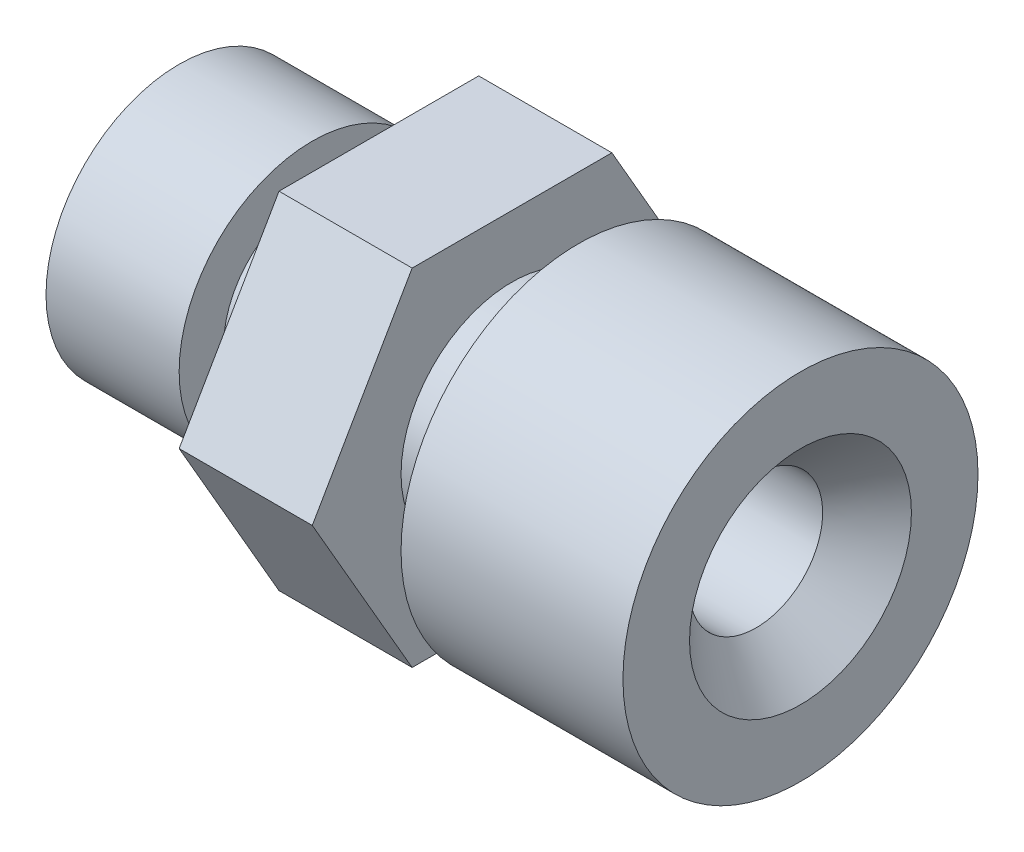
ISO-10303-21;
HEADER;
FILE_DESCRIPTION(('STEP AP214'),'2;1');
FILE_NAME('part.step','',(''),(''),'','','');
FILE_SCHEMA(('AUTOMOTIVE_DESIGN { 1 0 10303 214 1 1 1 1 }'));
ENDSEC;
DATA;
#1=APPLICATION_CONTEXT('core data for automotive mechanical design processes');
#2=APPLICATION_PROTOCOL_DEFINITION('international standard','automotive_design',2000,#1);
#3=PRODUCT_CONTEXT('',#1,'mechanical');
#4=PRODUCT('Part','Part','',(#3));
#5=PRODUCT_RELATED_PRODUCT_CATEGORY('part','',(#4));
#6=PRODUCT_DEFINITION_FORMATION('','',#4);
#7=PRODUCT_DEFINITION_CONTEXT('part definition',#1,'design');
#8=PRODUCT_DEFINITION('design','',#6,#7);
#9=PRODUCT_DEFINITION_SHAPE('','',#8);
#10=(LENGTH_UNIT() NAMED_UNIT(*) SI_UNIT(.MILLI.,.METRE.));
#11=(NAMED_UNIT(*) PLANE_ANGLE_UNIT() SI_UNIT($,.RADIAN.));
#12=(NAMED_UNIT(*) SI_UNIT($,.STERADIAN.) SOLID_ANGLE_UNIT());
#13=UNCERTAINTY_MEASURE_WITH_UNIT(LENGTH_MEASURE(1.E-05),#10,'distance_accuracy_value','');
#14=(GEOMETRIC_REPRESENTATION_CONTEXT(3) GLOBAL_UNCERTAINTY_ASSIGNED_CONTEXT((#13)) GLOBAL_UNIT_ASSIGNED_CONTEXT((#10,
#11,#12)) REPRESENTATION_CONTEXT('',''));
#15=CARTESIAN_POINT('',(0.,0.,0.));
#16=DIRECTION('',(0.,0.,1.));
#17=DIRECTION('',(1.,0.,0.));
#18=AXIS2_PLACEMENT_3D('',#15,#16,#17);
#19=CARTESIAN_POINT('',(15.,9.,0.));
#20=DIRECTION('',(-1.,0.,0.));
#21=DIRECTION('',(0.,0.,1.));
#22=AXIS2_PLACEMENT_3D('',#19,#20,#21);
#23=PLANE('',#22);
#24=CARTESIAN_POINT('',(15.,0.,0.));
#25=DIRECTION('',(-1.,0.,0.));
#26=DIRECTION('',(0.,0.,1.));
#27=AXIS2_PLACEMENT_3D('',#24,#25,#26);
#28=CIRCLE('',#27,5.);
#29=CARTESIAN_POINT('',(15.,0.,5.));
#30=VERTEX_POINT('',#29);
#31=EDGE_CURVE('E134',#30,#30,#28,.T.);
#32=ORIENTED_EDGE('',*,*,#31,.T.);
#33=EDGE_LOOP('',(#32));
#34=FACE_BOUND('',#33,.T.);
#35=DIRECTION('',(0.,0.,1.));
#36=VECTOR('',#35,1.);
#37=CARTESIAN_POINT('',(15.,7.79422863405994,-4.5));
#38=LINE('',#37,#36);
#39=CARTESIAN_POINT('',(15.,7.79422863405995,-4.5));
#40=VERTEX_POINT('',#39);
#41=CARTESIAN_POINT('',(15.,7.79422863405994,4.5));
#42=VERTEX_POINT('',#41);
#43=EDGE_CURVE('E40',#40,#42,#38,.T.);
#44=ORIENTED_EDGE('',*,*,#43,.T.);
#45=DIRECTION('',(0.,-0.866025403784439,0.5));
#46=VECTOR('',#45,1.);
#47=CARTESIAN_POINT('',(15.,7.79422863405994,4.5));
#48=LINE('',#47,#46);
#49=CARTESIAN_POINT('',(15.,0.,9.));
#50=VERTEX_POINT('',#49);
#51=EDGE_CURVE('E88',#42,#50,#48,.T.);
#52=ORIENTED_EDGE('',*,*,#51,.T.);
#53=DIRECTION('',(0.,-0.866025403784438,-0.5));
#54=VECTOR('',#53,1.);
#55=CARTESIAN_POINT('',(15.,0.,9.));
#56=LINE('',#55,#54);
#57=CARTESIAN_POINT('',(15.,-7.79422863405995,4.49999999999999));
#58=VERTEX_POINT('',#57);
#59=EDGE_CURVE('E94',#50,#58,#56,.T.);
#60=ORIENTED_EDGE('',*,*,#59,.T.);
#61=DIRECTION('',(0.,0.,-1.));
#62=VECTOR('',#61,1.);
#63=CARTESIAN_POINT('',(15.,-7.79422863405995,4.49999999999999));
#64=LINE('',#63,#62);
#65=CARTESIAN_POINT('',(15.,-7.79422863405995,-4.5));
#66=VERTEX_POINT('',#65);
#67=EDGE_CURVE('E104',#58,#66,#64,.T.);
#68=ORIENTED_EDGE('',*,*,#67,.T.);
#69=DIRECTION('',(0.,0.866025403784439,-0.5));
#70=VECTOR('',#69,1.);
#71=CARTESIAN_POINT('',(15.,-7.79422863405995,-4.5));
#72=LINE('',#71,#70);
#73=CARTESIAN_POINT('',(15.,0.,-9.));
#74=VERTEX_POINT('',#73);
#75=EDGE_CURVE('E107',#66,#74,#72,.T.);
#76=ORIENTED_EDGE('',*,*,#75,.T.);
#77=DIRECTION('',(0.,0.866025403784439,0.5));
#78=VECTOR('',#77,1.);
#79=CARTESIAN_POINT('',(15.,0.,-9.));
#80=LINE('',#79,#78);
#81=EDGE_CURVE('E98',#74,#40,#80,.T.);
#82=ORIENTED_EDGE('',*,*,#81,.T.);
#83=EDGE_LOOP('',(#44,#52,#60,#68,#76,#82));
#84=FACE_BOUND('',#83,.T.);
#85=ADVANCED_FACE('F25',(#34,#84),#23,.F.);
#86=CARTESIAN_POINT('',(8.99999999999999,4.,0.));
#87=DIRECTION('',(1.,0.,0.));
#88=DIRECTION('',(0.,0.,-1.));
#89=AXIS2_PLACEMENT_3D('',#86,#87,#88);
#90=PLANE('',#89);
#91=CARTESIAN_POINT('',(8.99999999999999,0.,0.));
#92=DIRECTION('',(-1.,0.,0.));
#93=DIRECTION('',(0.,0.,1.));
#94=AXIS2_PLACEMENT_3D('',#91,#92,#93);
#95=CIRCLE('',#94,4.);
#96=CARTESIAN_POINT('',(8.99999999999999,0.,4.));
#97=VERTEX_POINT('',#96);
#98=EDGE_CURVE('E131',#97,#97,#95,.T.);
#99=ORIENTED_EDGE('',*,*,#98,.F.);
#100=EDGE_LOOP('',(#99));
#101=FACE_BOUND('',#100,.T.);
#102=DIRECTION('',(0.,0.,-1.));
#103=VECTOR('',#102,1.);
#104=CARTESIAN_POINT('',(8.99999999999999,7.79422863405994,-4.5));
#105=LINE('',#104,#103);
#106=CARTESIAN_POINT('',(8.99999999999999,7.79422863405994,4.5));
#107=VERTEX_POINT('',#106);
#108=CARTESIAN_POINT('',(8.99999999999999,7.79422863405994,-4.5));
#109=VERTEX_POINT('',#108);
#110=EDGE_CURVE('E81',#107,#109,#105,.T.);
#111=ORIENTED_EDGE('',*,*,#110,.T.);
#112=DIRECTION('',(0.,-0.866025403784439,-0.5));
#113=VECTOR('',#112,1.);
#114=CARTESIAN_POINT('',(8.99999999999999,0.,-9.00000000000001));
#115=LINE('',#114,#113);
#116=CARTESIAN_POINT('',(8.99999999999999,0.,-9.00000000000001));
#117=VERTEX_POINT('',#116);
#118=EDGE_CURVE('E117',#109,#117,#115,.T.);
#119=ORIENTED_EDGE('',*,*,#118,.T.);
#120=DIRECTION('',(0.,-0.866025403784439,0.5));
#121=VECTOR('',#120,1.);
#122=CARTESIAN_POINT('',(8.99999999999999,-7.79422863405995,-4.5));
#123=LINE('',#122,#121);
#124=CARTESIAN_POINT('',(8.99999999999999,-7.79422863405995,-4.5));
#125=VERTEX_POINT('',#124);
#126=EDGE_CURVE('E229',#117,#125,#123,.T.);
#127=ORIENTED_EDGE('',*,*,#126,.T.);
#128=DIRECTION('',(0.,0.,1.));
#129=VECTOR('',#128,1.);
#130=CARTESIAN_POINT('',(8.99999999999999,-7.79422863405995,4.49999999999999));
#131=LINE('',#130,#129);
#132=CARTESIAN_POINT('',(8.99999999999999,-7.79422863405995,4.5));
#133=VERTEX_POINT('',#132);
#134=EDGE_CURVE('E225',#125,#133,#131,.T.);
#135=ORIENTED_EDGE('',*,*,#134,.T.);
#136=DIRECTION('',(0.,0.866025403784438,0.5));
#137=VECTOR('',#136,1.);
#138=CARTESIAN_POINT('',(9.00000000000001,0.,8.99999999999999));
#139=LINE('',#138,#137);
#140=CARTESIAN_POINT('',(9.00000000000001,0.,8.99999999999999));
#141=VERTEX_POINT('',#140);
#142=EDGE_CURVE('E223',#133,#141,#139,.T.);
#143=ORIENTED_EDGE('',*,*,#142,.T.);
#144=DIRECTION('',(0.,0.866025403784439,-0.5));
#145=VECTOR('',#144,1.);
#146=CARTESIAN_POINT('',(8.99999999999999,7.79422863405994,4.5));
#147=LINE('',#146,#145);
#148=EDGE_CURVE('E122',#141,#107,#147,.T.);
#149=ORIENTED_EDGE('',*,*,#148,.T.);
#150=EDGE_LOOP('',(#111,#119,#127,#135,#143,#149));
#151=FACE_BOUND('',#150,.T.);
#152=ADVANCED_FACE('F164',(#101,#151),#90,.F.);
#153=CARTESIAN_POINT('',(0.,0.,0.));
#154=DIRECTION('',(-1.,0.,0.));
#155=DIRECTION('',(0.,0.,1.));
#156=AXIS2_PLACEMENT_3D('',#153,#154,#155);
#157=CYLINDRICAL_SURFACE('',#156,2.99999999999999);
#158=CARTESIAN_POINT('',(26.,0.,0.));
#159=DIRECTION('',(-1.,0.,0.));
#160=DIRECTION('',(0.,0.,1.));
#161=AXIS2_PLACEMENT_3D('',#158,#159,#160);
#162=CIRCLE('',#161,2.99999999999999);
#163=CARTESIAN_POINT('',(26.,0.,2.99999999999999));
#164=VERTEX_POINT('',#163);
#165=EDGE_CURVE('E11',#164,#164,#162,.F.);
#166=ORIENTED_EDGE('',*,*,#165,.T.);
#167=EDGE_LOOP('',(#166));
#168=FACE_BOUND('',#167,.T.);
#169=CARTESIAN_POINT('',(0.,0.,0.));
#170=DIRECTION('',(-1.,0.,0.));
#171=DIRECTION('',(0.,0.,1.));
#172=AXIS2_PLACEMENT_3D('',#169,#170,#171);
#173=CIRCLE('',#172,2.99999999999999);
#174=CARTESIAN_POINT('',(0.,0.,2.99999999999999));
#175=VERTEX_POINT('',#174);
#176=EDGE_CURVE('E118',#175,#175,#173,.T.);
#177=ORIENTED_EDGE('',*,*,#176,.T.);
#178=EDGE_LOOP('',(#177));
#179=FACE_BOUND('',#178,.T.);
#180=ADVANCED_FACE('F27',(#168,#179),#157,.F.);
#181=CARTESIAN_POINT('',(28.,8.,0.));
#182=DIRECTION('',(-1.,0.,0.));
#183=DIRECTION('',(0.,0.,1.));
#184=AXIS2_PLACEMENT_3D('',#181,#182,#183);
#185=PLANE('',#184);
#186=CARTESIAN_POINT('',(28.,0.,0.));
#187=DIRECTION('',(-1.,0.,0.));
#188=DIRECTION('',(0.,0.,1.));
#189=AXIS2_PLACEMENT_3D('',#186,#187,#188);
#190=CIRCLE('',#189,5.);
#191=CARTESIAN_POINT('',(28.,0.,5.));
#192=VERTEX_POINT('',#191);
#193=EDGE_CURVE('E33',#192,#192,#190,.T.);
#194=ORIENTED_EDGE('',*,*,#193,.T.);
#195=EDGE_LOOP('',(#194));
#196=FACE_BOUND('',#195,.T.);
#197=CARTESIAN_POINT('',(28.,0.,0.));
#198=DIRECTION('',(-1.,0.,0.));
#199=DIRECTION('',(0.,0.,1.));
#200=AXIS2_PLACEMENT_3D('',#197,#198,#199);
#201=CIRCLE('',#200,8.);
#202=CARTESIAN_POINT('',(28.,0.,8.));
#203=VERTEX_POINT('',#202);
#204=EDGE_CURVE('E143',#203,#203,#201,.T.);
#205=ORIENTED_EDGE('',*,*,#204,.F.);
#206=EDGE_LOOP('',(#205));
#207=FACE_BOUND('',#206,.T.);
#208=ADVANCED_FACE('F148',(#196,#207),#185,.F.);
#209=CARTESIAN_POINT('',(0.,0.,0.));
#210=DIRECTION('',(-1.,0.,0.));
#211=DIRECTION('',(0.,0.,1.));
#212=AXIS2_PLACEMENT_3D('',#209,#210,#211);
#213=CYLINDRICAL_SURFACE('',#212,8.);
#214=CARTESIAN_POINT('',(18.,0.,0.));
#215=DIRECTION('',(-1.,0.,0.));
#216=DIRECTION('',(0.,0.,1.));
#217=AXIS2_PLACEMENT_3D('',#214,#215,#216);
#218=CIRCLE('',#217,8.);
#219=CARTESIAN_POINT('',(18.,0.,8.));
#220=VERTEX_POINT('',#219);
#221=EDGE_CURVE('E140',#220,#220,#218,.T.);
#222=ORIENTED_EDGE('',*,*,#221,.F.);
#223=EDGE_LOOP('',(#222));
#224=FACE_BOUND('',#223,.T.);
#225=ORIENTED_EDGE('',*,*,#204,.T.);
#226=EDGE_LOOP('',(#225));
#227=FACE_BOUND('',#226,.T.);
#228=ADVANCED_FACE('F183',(#224,#227),#213,.T.);
#229=CARTESIAN_POINT('',(18.,5.,0.));
#230=DIRECTION('',(1.,0.,0.));
#231=DIRECTION('',(0.,0.,-1.));
#232=AXIS2_PLACEMENT_3D('',#229,#230,#231);
#233=PLANE('',#232);
#234=CARTESIAN_POINT('',(18.,0.,0.));
#235=DIRECTION('',(-1.,0.,0.));
#236=DIRECTION('',(0.,0.,1.));
#237=AXIS2_PLACEMENT_3D('',#234,#235,#236);
#238=CIRCLE('',#237,5.);
#239=CARTESIAN_POINT('',(18.,0.,5.));
#240=VERTEX_POINT('',#239);
#241=EDGE_CURVE('E137',#240,#240,#238,.T.);
#242=ORIENTED_EDGE('',*,*,#241,.F.);
#243=EDGE_LOOP('',(#242));
#244=FACE_BOUND('',#243,.T.);
#245=ORIENTED_EDGE('',*,*,#221,.T.);
#246=EDGE_LOOP('',(#245));
#247=FACE_BOUND('',#246,.T.);
#248=ADVANCED_FACE('F179',(#244,#247),#233,.F.);
#249=CARTESIAN_POINT('',(0.,0.,0.));
#250=DIRECTION('',(-1.,0.,0.));
#251=DIRECTION('',(0.,0.,1.));
#252=AXIS2_PLACEMENT_3D('',#249,#250,#251);
#253=CYLINDRICAL_SURFACE('',#252,5.);
#254=ORIENTED_EDGE('',*,*,#31,.F.);
#255=EDGE_LOOP('',(#254));
#256=FACE_BOUND('',#255,.T.);
#257=ORIENTED_EDGE('',*,*,#241,.T.);
#258=EDGE_LOOP('',(#257));
#259=FACE_BOUND('',#258,.T.);
#260=ADVANCED_FACE('F175',(#256,#259),#253,.T.);
#261=CARTESIAN_POINT('',(0.,0.,0.));
#262=DIRECTION('',(-1.,0.,0.));
#263=DIRECTION('',(0.,0.,1.));
#264=AXIS2_PLACEMENT_3D('',#261,#262,#263);
#265=CYLINDRICAL_SURFACE('',#264,4.);
#266=CARTESIAN_POINT('',(5.99999999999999,0.,0.));
#267=DIRECTION('',(-1.,0.,0.));
#268=DIRECTION('',(0.,0.,1.));
#269=AXIS2_PLACEMENT_3D('',#266,#267,#268);
#270=CIRCLE('',#269,4.);
#271=CARTESIAN_POINT('',(5.99999999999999,0.,4.));
#272=VERTEX_POINT('',#271);
#273=EDGE_CURVE('E128',#272,#272,#270,.T.);
#274=ORIENTED_EDGE('',*,*,#273,.F.);
#275=EDGE_LOOP('',(#274));
#276=FACE_BOUND('',#275,.T.);
#277=ORIENTED_EDGE('',*,*,#98,.T.);
#278=EDGE_LOOP('',(#277));
#279=FACE_BOUND('',#278,.T.);
#280=ADVANCED_FACE('F178',(#276,#279),#265,.T.);
#281=CARTESIAN_POINT('',(5.99999999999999,6.,0.));
#282=DIRECTION('',(-1.,0.,0.));
#283=DIRECTION('',(0.,0.,1.));
#284=AXIS2_PLACEMENT_3D('',#281,#282,#283);
#285=PLANE('',#284);
#286=CARTESIAN_POINT('',(5.99999999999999,0.,0.));
#287=DIRECTION('',(-1.,0.,0.));
#288=DIRECTION('',(0.,0.,1.));
#289=AXIS2_PLACEMENT_3D('',#286,#287,#288);
#290=CIRCLE('',#289,6.);
#291=CARTESIAN_POINT('',(5.99999999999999,0.,6.));
#292=VERTEX_POINT('',#291);
#293=EDGE_CURVE('E125',#292,#292,#290,.T.);
#294=ORIENTED_EDGE('',*,*,#293,.F.);
#295=EDGE_LOOP('',(#294));
#296=FACE_BOUND('',#295,.T.);
#297=ORIENTED_EDGE('',*,*,#273,.T.);
#298=EDGE_LOOP('',(#297));
#299=FACE_BOUND('',#298,.T.);
#300=ADVANCED_FACE('F206',(#296,#299),#285,.F.);
#301=CARTESIAN_POINT('',(0.,0.,0.));
#302=DIRECTION('',(-1.,0.,0.));
#303=DIRECTION('',(0.,0.,1.));
#304=AXIS2_PLACEMENT_3D('',#301,#302,#303);
#305=CYLINDRICAL_SURFACE('',#304,6.);
#306=CARTESIAN_POINT('',(0.,0.,0.));
#307=DIRECTION('',(-1.,0.,0.));
#308=DIRECTION('',(0.,0.,1.));
#309=AXIS2_PLACEMENT_3D('',#306,#307,#308);
#310=CIRCLE('',#309,6.);
#311=CARTESIAN_POINT('',(0.,0.,6.));
#312=VERTEX_POINT('',#311);
#313=EDGE_CURVE('E121',#312,#312,#310,.T.);
#314=ORIENTED_EDGE('',*,*,#313,.F.);
#315=EDGE_LOOP('',(#314));
#316=FACE_BOUND('',#315,.T.);
#317=ORIENTED_EDGE('',*,*,#293,.T.);
#318=EDGE_LOOP('',(#317));
#319=FACE_BOUND('',#318,.T.);
#320=ADVANCED_FACE('F200',(#316,#319),#305,.T.);
#321=CARTESIAN_POINT('',(0.,2.99999999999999,0.));
#322=DIRECTION('',(1.,0.,0.));
#323=DIRECTION('',(0.,0.,-1.));
#324=AXIS2_PLACEMENT_3D('',#321,#322,#323);
#325=PLANE('',#324);
#326=ORIENTED_EDGE('',*,*,#176,.F.);
#327=EDGE_LOOP('',(#326));
#328=FACE_BOUND('',#327,.T.);
#329=ORIENTED_EDGE('',*,*,#313,.T.);
#330=EDGE_LOOP('',(#329));
#331=FACE_BOUND('',#330,.T.);
#332=ADVANCED_FACE('F197',(#328,#331),#325,.F.);
#333=CARTESIAN_POINT('',(-23.2997975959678,7.79422863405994,-4.5));
#334=DIRECTION('',(0.,1.,0.));
#335=DIRECTION('',(0.,0.,1.));
#336=AXIS2_PLACEMENT_3D('',#333,#334,#335);
#337=PLANE('',#336);
#338=DIRECTION('',(1.,0.,0.));
#339=VECTOR('',#338,1.);
#340=CARTESIAN_POINT('',(-23.2997975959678,7.79422863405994,4.5));
#341=LINE('',#340,#339);
#342=EDGE_CURVE('E77',#107,#42,#341,.T.);
#343=ORIENTED_EDGE('',*,*,#342,.T.);
#344=ORIENTED_EDGE('',*,*,#43,.F.);
#345=DIRECTION('',(1.,0.,0.));
#346=VECTOR('',#345,1.);
#347=CARTESIAN_POINT('',(-23.2997975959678,7.79422863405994,-4.5));
#348=LINE('',#347,#346);
#349=EDGE_CURVE('E85',#109,#40,#348,.T.);
#350=ORIENTED_EDGE('',*,*,#349,.F.);
#351=ORIENTED_EDGE('',*,*,#110,.F.);
#352=EDGE_LOOP('',(#343,#344,#350,#351));
#353=FACE_BOUND('',#352,.T.);
#354=ADVANCED_FACE('F79',(#353),#337,.T.);
#355=CARTESIAN_POINT('',(-23.2997975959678,7.79422863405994,4.5));
#356=DIRECTION('',(0.,0.5,0.866025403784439));
#357=DIRECTION('',(0.,-0.866025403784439,0.5));
#358=AXIS2_PLACEMENT_3D('',#355,#356,#357);
#359=PLANE('',#358);
#360=DIRECTION('',(1.,0.,0.));
#361=VECTOR('',#360,1.);
#362=CARTESIAN_POINT('',(-23.2997975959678,0.,9.));
#363=LINE('',#362,#361);
#364=EDGE_CURVE('E84',#141,#50,#363,.T.);
#365=ORIENTED_EDGE('',*,*,#364,.T.);
#366=ORIENTED_EDGE('',*,*,#51,.F.);
#367=ORIENTED_EDGE('',*,*,#342,.F.);
#368=ORIENTED_EDGE('',*,*,#148,.F.);
#369=EDGE_LOOP('',(#365,#366,#367,#368));
#370=FACE_BOUND('',#369,.T.);
#371=ADVANCED_FACE('F89',(#370),#359,.T.);
#372=CARTESIAN_POINT('',(-23.2997975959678,0.,9.));
#373=DIRECTION('',(0.,-0.5,0.866025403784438));
#374=DIRECTION('',(0.,-0.866025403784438,-0.5));
#375=AXIS2_PLACEMENT_3D('',#372,#373,#374);
#376=PLANE('',#375);
#377=DIRECTION('',(1.,0.,0.));
#378=VECTOR('',#377,1.);
#379=CARTESIAN_POINT('',(-23.2997975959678,-7.79422863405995,4.49999999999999));
#380=LINE('',#379,#378);
#381=EDGE_CURVE('E112',#133,#58,#380,.T.);
#382=ORIENTED_EDGE('',*,*,#381,.T.);
#383=ORIENTED_EDGE('',*,*,#59,.F.);
#384=ORIENTED_EDGE('',*,*,#364,.F.);
#385=ORIENTED_EDGE('',*,*,#142,.F.);
#386=EDGE_LOOP('',(#382,#383,#384,#385));
#387=FACE_BOUND('',#386,.T.);
#388=ADVANCED_FACE('F238',(#387),#376,.T.);
#389=CARTESIAN_POINT('',(-23.2997975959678,-7.79422863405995,4.49999999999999));
#390=DIRECTION('',(0.,-1.,0.));
#391=DIRECTION('',(0.,0.,-1.));
#392=AXIS2_PLACEMENT_3D('',#389,#390,#391);
#393=PLANE('',#392);
#394=DIRECTION('',(1.,0.,0.));
#395=VECTOR('',#394,1.);
#396=CARTESIAN_POINT('',(-23.2997975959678,-7.79422863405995,-4.5));
#397=LINE('',#396,#395);
#398=EDGE_CURVE('E110',#125,#66,#397,.T.);
#399=ORIENTED_EDGE('',*,*,#398,.T.);
#400=ORIENTED_EDGE('',*,*,#67,.F.);
#401=ORIENTED_EDGE('',*,*,#381,.F.);
#402=ORIENTED_EDGE('',*,*,#134,.F.);
#403=EDGE_LOOP('',(#399,#400,#401,#402));
#404=FACE_BOUND('',#403,.T.);
#405=ADVANCED_FACE('F235',(#404),#393,.T.);
#406=CARTESIAN_POINT('',(-23.2997975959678,-7.79422863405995,-4.5));
#407=DIRECTION('',(0.,-0.5,-0.866025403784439));
#408=DIRECTION('',(0.,0.866025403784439,-0.5));
#409=AXIS2_PLACEMENT_3D('',#406,#407,#408);
#410=PLANE('',#409);
#411=DIRECTION('',(1.,0.,0.));
#412=VECTOR('',#411,1.);
#413=CARTESIAN_POINT('',(-23.2997975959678,0.,-9.));
#414=LINE('',#413,#412);
#415=EDGE_CURVE('E48',#117,#74,#414,.T.);
#416=ORIENTED_EDGE('',*,*,#415,.T.);
#417=ORIENTED_EDGE('',*,*,#75,.F.);
#418=ORIENTED_EDGE('',*,*,#398,.F.);
#419=ORIENTED_EDGE('',*,*,#126,.F.);
#420=EDGE_LOOP('',(#416,#417,#418,#419));
#421=FACE_BOUND('',#420,.T.);
#422=ADVANCED_FACE('F159',(#421),#410,.T.);
#423=CARTESIAN_POINT('',(-23.2997975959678,0.,-9.));
#424=DIRECTION('',(0.,0.5,-0.866025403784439));
#425=DIRECTION('',(0.,0.866025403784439,0.5));
#426=AXIS2_PLACEMENT_3D('',#423,#424,#425);
#427=PLANE('',#426);
#428=ORIENTED_EDGE('',*,*,#349,.T.);
#429=ORIENTED_EDGE('',*,*,#81,.F.);
#430=ORIENTED_EDGE('',*,*,#415,.F.);
#431=ORIENTED_EDGE('',*,*,#118,.F.);
#432=EDGE_LOOP('',(#428,#429,#430,#431));
#433=FACE_BOUND('',#432,.T.);
#434=ADVANCED_FACE('F153',(#433),#427,.T.);
#435=CARTESIAN_POINT('',(28.,0.,0.));
#436=DIRECTION('',(1.,0.,0.));
#437=DIRECTION('',(0.,0.,-1.));
#438=AXIS2_PLACEMENT_3D('',#435,#436,#437);
#439=CONICAL_SURFACE('',#438,5.,0.785398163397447);
#440=ORIENTED_EDGE('',*,*,#165,.F.);
#441=EDGE_LOOP('',(#440));
#442=FACE_BOUND('',#441,.T.);
#443=ORIENTED_EDGE('',*,*,#193,.F.);
#444=EDGE_LOOP('',(#443));
#445=FACE_BOUND('',#444,.T.);
#446=ADVANCED_FACE('F151',(#442,#445),#439,.F.);
#447=CLOSED_SHELL('',(#85,#152,#180,#208,#228,#248,#260,#280,#300,#320,#332,#354,#371,#388,#405,
#422,#434,#446));
#448=MANIFOLD_SOLID_BREP('B2',#447);
#449=ADVANCED_BREP_SHAPE_REPRESENTATION('',(#18,#448),#14);
#450=SHAPE_DEFINITION_REPRESENTATION(#9,#449);
ENDSEC;
END-ISO-10303-21;
